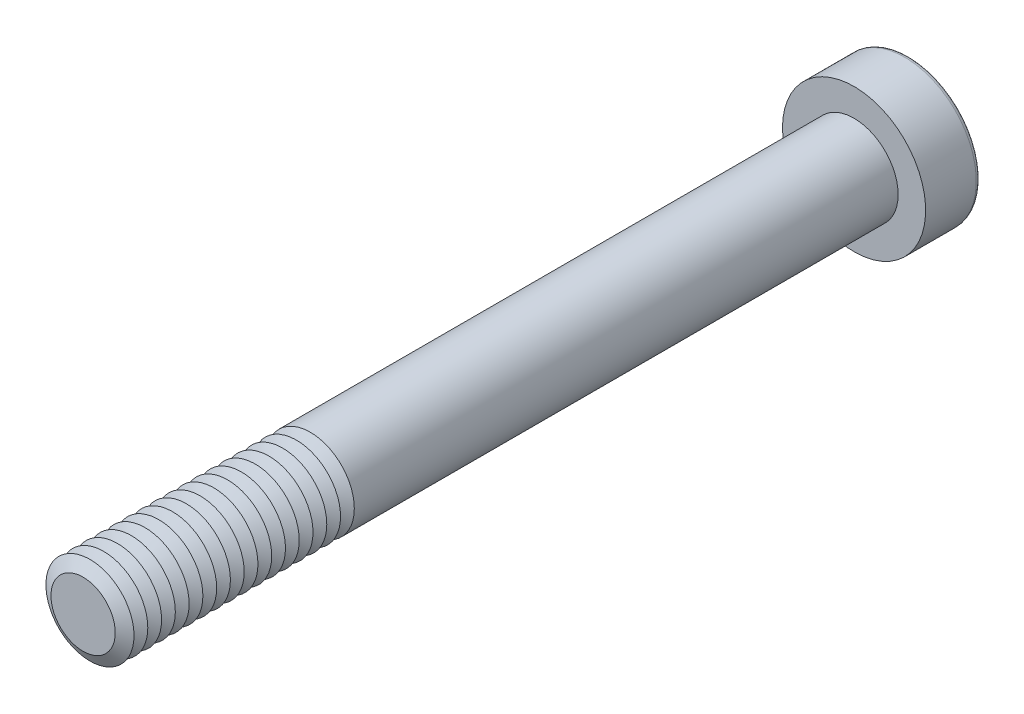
ISO-10303-21;
HEADER;
FILE_DESCRIPTION(('STEP AP214'),'2;1');
FILE_NAME('part.step','',(''),(''),'','','');
FILE_SCHEMA(('AUTOMOTIVE_DESIGN { 1 0 10303 214 1 1 1 1 }'));
ENDSEC;
DATA;
#1=APPLICATION_CONTEXT('core data for automotive mechanical design processes');
#2=APPLICATION_PROTOCOL_DEFINITION('international standard','automotive_design',2000,#1);
#3=PRODUCT_CONTEXT('',#1,'mechanical');
#4=PRODUCT('Part','Part','',(#3));
#5=PRODUCT_RELATED_PRODUCT_CATEGORY('part','',(#4));
#6=PRODUCT_DEFINITION_FORMATION('','',#4);
#7=PRODUCT_DEFINITION_CONTEXT('part definition',#1,'design');
#8=PRODUCT_DEFINITION('design','',#6,#7);
#9=PRODUCT_DEFINITION_SHAPE('','',#8);
#10=(LENGTH_UNIT() NAMED_UNIT(*) SI_UNIT(.MILLI.,.METRE.));
#11=(NAMED_UNIT(*) PLANE_ANGLE_UNIT() SI_UNIT($,.RADIAN.));
#12=(NAMED_UNIT(*) SI_UNIT($,.STERADIAN.) SOLID_ANGLE_UNIT());
#13=UNCERTAINTY_MEASURE_WITH_UNIT(LENGTH_MEASURE(1.E-05),#10,'distance_accuracy_value','');
#14=(GEOMETRIC_REPRESENTATION_CONTEXT(3) GLOBAL_UNCERTAINTY_ASSIGNED_CONTEXT((#13)) GLOBAL_UNIT_ASSIGNED_CONTEXT((#10,
#11,#12)) REPRESENTATION_CONTEXT('',''));
#15=CARTESIAN_POINT('',(0.,0.,0.));
#16=DIRECTION('',(0.,0.,1.));
#17=DIRECTION('',(1.,0.,0.));
#18=AXIS2_PLACEMENT_3D('',#15,#16,#17);
#19=CARTESIAN_POINT('',(0.,0.,65.625));
#20=DIRECTION('',(0.,0.,1.));
#21=DIRECTION('',(1.,0.,0.));
#22=AXIS2_PLACEMENT_3D('',#19,#20,#21);
#23=CONICAL_SURFACE('',#22,4.,1.0471975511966);
#24=CARTESIAN_POINT('',(0.,0.,65.));
#25=DIRECTION('',(0.,0.,1.));
#26=DIRECTION('',(1.,0.,0.));
#27=AXIS2_PLACEMENT_3D('',#24,#25,#26);
#28=CIRCLE('',#27,2.91746824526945);
#29=CARTESIAN_POINT('',(2.91746824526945,0.,65.));
#30=VERTEX_POINT('',#29);
#31=EDGE_CURVE('E313',#30,#30,#28,.T.);
#32=ORIENTED_EDGE('',*,*,#31,.T.);
#33=EDGE_LOOP('',(#32));
#34=FACE_BOUND('',#33,.T.);
#35=CARTESIAN_POINT('',(0.,0.,65.625));
#36=DIRECTION('',(0.,0.,1.));
#37=DIRECTION('',(1.,0.,0.));
#38=AXIS2_PLACEMENT_3D('',#35,#36,#37);
#39=CIRCLE('',#38,4.);
#40=CARTESIAN_POINT('',(4.,0.,65.625));
#41=VERTEX_POINT('',#40);
#42=EDGE_CURVE('E316',#41,#41,#39,.T.);
#43=ORIENTED_EDGE('',*,*,#42,.F.);
#44=EDGE_LOOP('',(#43));
#45=FACE_BOUND('',#44,.T.);
#46=ADVANCED_FACE('F39',(#34,#45),#23,.T.);
#47=CARTESIAN_POINT('',(0.,0.,65.));
#48=DIRECTION('',(0.,0.,-1.));
#49=DIRECTION('',(-1.,0.,0.));
#50=AXIS2_PLACEMENT_3D('',#47,#48,#49);
#51=CONICAL_SURFACE('',#50,2.91746824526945,1.0471975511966);
#52=CARTESIAN_POINT('',(0.,0.,64.375));
#53=DIRECTION('',(0.,0.,1.));
#54=DIRECTION('',(1.,0.,0.));
#55=AXIS2_PLACEMENT_3D('',#52,#53,#54);
#56=CIRCLE('',#55,4.);
#57=CARTESIAN_POINT('',(4.,0.,64.375));
#58=VERTEX_POINT('',#57);
#59=EDGE_CURVE('E324',#58,#58,#56,.T.);
#60=ORIENTED_EDGE('',*,*,#59,.T.);
#61=EDGE_LOOP('',(#60));
#62=FACE_BOUND('',#61,.T.);
#63=ORIENTED_EDGE('',*,*,#31,.F.);
#64=EDGE_LOOP('',(#63));
#65=FACE_BOUND('',#64,.T.);
#66=ADVANCED_FACE('F245',(#62,#65),#51,.T.);
#67=CARTESIAN_POINT('',(0.,0.,70.));
#68=DIRECTION('',(0.,0.,1.));
#69=DIRECTION('',(1.,0.,0.));
#70=AXIS2_PLACEMENT_3D('',#67,#68,#69);
#71=PLANE('',#70);
#72=CARTESIAN_POINT('',(0.,0.,70.));
#73=DIRECTION('',(0.,0.,1.));
#74=DIRECTION('',(1.,0.,0.));
#75=AXIS2_PLACEMENT_3D('',#72,#73,#74);
#76=CIRCLE('',#75,2.91746824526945);
#77=CARTESIAN_POINT('',(2.91746824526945,0.,70.));
#78=VERTEX_POINT('',#77);
#79=EDGE_CURVE('E174',#78,#78,#76,.T.);
#80=ORIENTED_EDGE('',*,*,#79,.T.);
#81=EDGE_LOOP('',(#80));
#82=FACE_BOUND('',#81,.T.);
#83=ADVANCED_FACE('F251',(#82),#71,.T.);
#84=CARTESIAN_POINT('',(0.,0.,70.));
#85=DIRECTION('',(0.,0.,-1.));
#86=DIRECTION('',(-1.,0.,0.));
#87=AXIS2_PLACEMENT_3D('',#84,#85,#86);
#88=CONICAL_SURFACE('',#87,2.91746824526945,1.0471975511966);
#89=CARTESIAN_POINT('',(0.,0.,69.375));
#90=DIRECTION('',(0.,0.,1.));
#91=DIRECTION('',(1.,0.,0.));
#92=AXIS2_PLACEMENT_3D('',#89,#90,#91);
#93=CIRCLE('',#92,4.);
#94=CARTESIAN_POINT('',(4.,0.,69.375));
#95=VERTEX_POINT('',#94);
#96=EDGE_CURVE('E291',#95,#95,#93,.T.);
#97=ORIENTED_EDGE('',*,*,#96,.T.);
#98=EDGE_LOOP('',(#97));
#99=FACE_BOUND('',#98,.T.);
#100=ORIENTED_EDGE('',*,*,#79,.F.);
#101=EDGE_LOOP('',(#100));
#102=FACE_BOUND('',#101,.T.);
#103=ADVANCED_FACE('F199',(#99,#102),#88,.T.);
#104=CARTESIAN_POINT('',(0.,0.,69.375));
#105=DIRECTION('',(0.,0.,1.));
#106=DIRECTION('',(1.,0.,0.));
#107=AXIS2_PLACEMENT_3D('',#104,#105,#106);
#108=CONICAL_SURFACE('',#107,4.,1.0471975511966);
#109=CARTESIAN_POINT('',(0.,0.,68.75));
#110=DIRECTION('',(0.,0.,1.));
#111=DIRECTION('',(1.,0.,0.));
#112=AXIS2_PLACEMENT_3D('',#109,#110,#111);
#113=CIRCLE('',#112,2.91746824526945);
#114=CARTESIAN_POINT('',(2.91746824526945,0.,68.75));
#115=VERTEX_POINT('',#114);
#116=EDGE_CURVE('E288',#115,#115,#113,.T.);
#117=ORIENTED_EDGE('',*,*,#116,.T.);
#118=EDGE_LOOP('',(#117));
#119=FACE_BOUND('',#118,.T.);
#120=ORIENTED_EDGE('',*,*,#96,.F.);
#121=EDGE_LOOP('',(#120));
#122=FACE_BOUND('',#121,.T.);
#123=ADVANCED_FACE('F277',(#119,#122),#108,.T.);
#124=CARTESIAN_POINT('',(0.,0.,68.75));
#125=DIRECTION('',(0.,0.,-1.));
#126=DIRECTION('',(-1.,0.,0.));
#127=AXIS2_PLACEMENT_3D('',#124,#125,#126);
#128=CONICAL_SURFACE('',#127,2.91746824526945,1.0471975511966);
#129=CARTESIAN_POINT('',(0.,0.,68.125));
#130=DIRECTION('',(0.,0.,1.));
#131=DIRECTION('',(1.,0.,0.));
#132=AXIS2_PLACEMENT_3D('',#129,#130,#131);
#133=CIRCLE('',#132,4.);
#134=CARTESIAN_POINT('',(4.,0.,68.125));
#135=VERTEX_POINT('',#134);
#136=EDGE_CURVE('E299',#135,#135,#133,.T.);
#137=ORIENTED_EDGE('',*,*,#136,.T.);
#138=EDGE_LOOP('',(#137));
#139=FACE_BOUND('',#138,.T.);
#140=ORIENTED_EDGE('',*,*,#116,.F.);
#141=EDGE_LOOP('',(#140));
#142=FACE_BOUND('',#141,.T.);
#143=ADVANCED_FACE('F274',(#139,#142),#128,.T.);
#144=CARTESIAN_POINT('',(0.,0.,68.125));
#145=DIRECTION('',(0.,0.,1.));
#146=DIRECTION('',(1.,0.,0.));
#147=AXIS2_PLACEMENT_3D('',#144,#145,#146);
#148=CONICAL_SURFACE('',#147,4.,1.0471975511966);
#149=CARTESIAN_POINT('',(0.,0.,67.5));
#150=DIRECTION('',(0.,0.,1.));
#151=DIRECTION('',(1.,0.,0.));
#152=AXIS2_PLACEMENT_3D('',#149,#150,#151);
#153=CIRCLE('',#152,2.91746824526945);
#154=CARTESIAN_POINT('',(2.91746824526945,0.,67.5));
#155=VERTEX_POINT('',#154);
#156=EDGE_CURVE('E293',#155,#155,#153,.T.);
#157=ORIENTED_EDGE('',*,*,#156,.T.);
#158=EDGE_LOOP('',(#157));
#159=FACE_BOUND('',#158,.T.);
#160=ORIENTED_EDGE('',*,*,#136,.F.);
#161=EDGE_LOOP('',(#160));
#162=FACE_BOUND('',#161,.T.);
#163=ADVANCED_FACE('F270',(#159,#162),#148,.T.);
#164=CARTESIAN_POINT('',(0.,0.,67.5));
#165=DIRECTION('',(0.,0.,-1.));
#166=DIRECTION('',(-1.,0.,0.));
#167=AXIS2_PLACEMENT_3D('',#164,#165,#166);
#168=CONICAL_SURFACE('',#167,2.91746824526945,1.0471975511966);
#169=CARTESIAN_POINT('',(0.,0.,66.875));
#170=DIRECTION('',(0.,0.,1.));
#171=DIRECTION('',(1.,0.,0.));
#172=AXIS2_PLACEMENT_3D('',#169,#170,#171);
#173=CIRCLE('',#172,4.);
#174=CARTESIAN_POINT('',(4.,0.,66.875));
#175=VERTEX_POINT('',#174);
#176=EDGE_CURVE('E309',#175,#175,#173,.T.);
#177=ORIENTED_EDGE('',*,*,#176,.T.);
#178=EDGE_LOOP('',(#177));
#179=FACE_BOUND('',#178,.T.);
#180=ORIENTED_EDGE('',*,*,#156,.F.);
#181=EDGE_LOOP('',(#180));
#182=FACE_BOUND('',#181,.T.);
#183=ADVANCED_FACE('F266',(#179,#182),#168,.T.);
#184=CARTESIAN_POINT('',(0.,0.,66.875));
#185=DIRECTION('',(0.,0.,1.));
#186=DIRECTION('',(1.,0.,0.));
#187=AXIS2_PLACEMENT_3D('',#184,#185,#186);
#188=CONICAL_SURFACE('',#187,4.,1.0471975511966);
#189=CARTESIAN_POINT('',(0.,0.,66.25));
#190=DIRECTION('',(0.,0.,1.));
#191=DIRECTION('',(1.,0.,0.));
#192=AXIS2_PLACEMENT_3D('',#189,#190,#191);
#193=CIRCLE('',#192,2.91746824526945);
#194=CARTESIAN_POINT('',(2.91746824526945,0.,66.25));
#195=VERTEX_POINT('',#194);
#196=EDGE_CURVE('E305',#195,#195,#193,.T.);
#197=ORIENTED_EDGE('',*,*,#196,.T.);
#198=EDGE_LOOP('',(#197));
#199=FACE_BOUND('',#198,.T.);
#200=ORIENTED_EDGE('',*,*,#176,.F.);
#201=EDGE_LOOP('',(#200));
#202=FACE_BOUND('',#201,.T.);
#203=ADVANCED_FACE('F262',(#199,#202),#188,.T.);
#204=CARTESIAN_POINT('',(0.,0.,66.25));
#205=DIRECTION('',(0.,0.,-1.));
#206=DIRECTION('',(-1.,0.,0.));
#207=AXIS2_PLACEMENT_3D('',#204,#205,#206);
#208=CONICAL_SURFACE('',#207,2.91746824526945,1.0471975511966);
#209=ORIENTED_EDGE('',*,*,#42,.T.);
#210=EDGE_LOOP('',(#209));
#211=FACE_BOUND('',#210,.T.);
#212=ORIENTED_EDGE('',*,*,#196,.F.);
#213=EDGE_LOOP('',(#212));
#214=FACE_BOUND('',#213,.T.);
#215=ADVANCED_FACE('F258',(#211,#214),#208,.T.);
#216=CARTESIAN_POINT('',(0.,0.,64.375));
#217=DIRECTION('',(0.,0.,1.));
#218=DIRECTION('',(1.,0.,0.));
#219=AXIS2_PLACEMENT_3D('',#216,#217,#218);
#220=CONICAL_SURFACE('',#219,4.,1.0471975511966);
#221=CARTESIAN_POINT('',(0.,0.,63.75));
#222=DIRECTION('',(0.,0.,1.));
#223=DIRECTION('',(1.,0.,0.));
#224=AXIS2_PLACEMENT_3D('',#221,#222,#223);
#225=CIRCLE('',#224,2.91746824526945);
#226=CARTESIAN_POINT('',(2.91746824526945,0.,63.75));
#227=VERTEX_POINT('',#226);
#228=EDGE_CURVE('E320',#227,#227,#225,.T.);
#229=ORIENTED_EDGE('',*,*,#228,.T.);
#230=EDGE_LOOP('',(#229));
#231=FACE_BOUND('',#230,.T.);
#232=ORIENTED_EDGE('',*,*,#59,.F.);
#233=EDGE_LOOP('',(#232));
#234=FACE_BOUND('',#233,.T.);
#235=ADVANCED_FACE('F261',(#231,#234),#220,.T.);
#236=CARTESIAN_POINT('',(0.,0.,63.75));
#237=DIRECTION('',(0.,0.,-1.));
#238=DIRECTION('',(-1.,0.,0.));
#239=AXIS2_PLACEMENT_3D('',#236,#237,#238);
#240=CONICAL_SURFACE('',#239,2.91746824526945,1.0471975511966);
#241=CARTESIAN_POINT('',(0.,0.,63.125));
#242=DIRECTION('',(0.,0.,1.));
#243=DIRECTION('',(1.,0.,0.));
#244=AXIS2_PLACEMENT_3D('',#241,#242,#243);
#245=CIRCLE('',#244,4.);
#246=CARTESIAN_POINT('',(4.,0.,63.125));
#247=VERTEX_POINT('',#246);
#248=EDGE_CURVE('E332',#247,#247,#245,.T.);
#249=ORIENTED_EDGE('',*,*,#248,.T.);
#250=EDGE_LOOP('',(#249));
#251=FACE_BOUND('',#250,.T.);
#252=ORIENTED_EDGE('',*,*,#228,.F.);
#253=EDGE_LOOP('',(#252));
#254=FACE_BOUND('',#253,.T.);
#255=ADVANCED_FACE('F513',(#251,#254),#240,.T.);
#256=CARTESIAN_POINT('',(0.,0.,63.125));
#257=DIRECTION('',(0.,0.,1.));
#258=DIRECTION('',(1.,0.,0.));
#259=AXIS2_PLACEMENT_3D('',#256,#257,#258);
#260=CONICAL_SURFACE('',#259,4.,1.0471975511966);
#261=CARTESIAN_POINT('',(0.,0.,62.5));
#262=DIRECTION('',(0.,0.,1.));
#263=DIRECTION('',(1.,0.,0.));
#264=AXIS2_PLACEMENT_3D('',#261,#262,#263);
#265=CIRCLE('',#264,2.91746824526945);
#266=CARTESIAN_POINT('',(2.91746824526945,0.,62.5));
#267=VERTEX_POINT('',#266);
#268=EDGE_CURVE('E328',#267,#267,#265,.T.);
#269=ORIENTED_EDGE('',*,*,#268,.T.);
#270=EDGE_LOOP('',(#269));
#271=FACE_BOUND('',#270,.T.);
#272=ORIENTED_EDGE('',*,*,#248,.F.);
#273=EDGE_LOOP('',(#272));
#274=FACE_BOUND('',#273,.T.);
#275=ADVANCED_FACE('F509',(#271,#274),#260,.T.);
#276=CARTESIAN_POINT('',(0.,0.,62.5));
#277=DIRECTION('',(0.,0.,-1.));
#278=DIRECTION('',(-1.,0.,0.));
#279=AXIS2_PLACEMENT_3D('',#276,#277,#278);
#280=CONICAL_SURFACE('',#279,2.91746824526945,1.0471975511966);
#281=CARTESIAN_POINT('',(0.,0.,61.875));
#282=DIRECTION('',(0.,0.,1.));
#283=DIRECTION('',(1.,0.,0.));
#284=AXIS2_PLACEMENT_3D('',#281,#282,#283);
#285=CIRCLE('',#284,4.);
#286=CARTESIAN_POINT('',(4.,0.,61.875));
#287=VERTEX_POINT('',#286);
#288=EDGE_CURVE('E340',#287,#287,#285,.T.);
#289=ORIENTED_EDGE('',*,*,#288,.T.);
#290=EDGE_LOOP('',(#289));
#291=FACE_BOUND('',#290,.T.);
#292=ORIENTED_EDGE('',*,*,#268,.F.);
#293=EDGE_LOOP('',(#292));
#294=FACE_BOUND('',#293,.T.);
#295=ADVANCED_FACE('F505',(#291,#294),#280,.T.);
#296=CARTESIAN_POINT('',(0.,0.,61.875));
#297=DIRECTION('',(0.,0.,1.));
#298=DIRECTION('',(1.,0.,0.));
#299=AXIS2_PLACEMENT_3D('',#296,#297,#298);
#300=CONICAL_SURFACE('',#299,4.,1.0471975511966);
#301=CARTESIAN_POINT('',(0.,0.,61.25));
#302=DIRECTION('',(0.,0.,1.));
#303=DIRECTION('',(1.,0.,0.));
#304=AXIS2_PLACEMENT_3D('',#301,#302,#303);
#305=CIRCLE('',#304,2.91746824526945);
#306=CARTESIAN_POINT('',(2.91746824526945,0.,61.25));
#307=VERTEX_POINT('',#306);
#308=EDGE_CURVE('E336',#307,#307,#305,.T.);
#309=ORIENTED_EDGE('',*,*,#308,.T.);
#310=EDGE_LOOP('',(#309));
#311=FACE_BOUND('',#310,.T.);
#312=ORIENTED_EDGE('',*,*,#288,.F.);
#313=EDGE_LOOP('',(#312));
#314=FACE_BOUND('',#313,.T.);
#315=ADVANCED_FACE('F501',(#311,#314),#300,.T.);
#316=CARTESIAN_POINT('',(0.,0.,61.25));
#317=DIRECTION('',(0.,0.,-1.));
#318=DIRECTION('',(-1.,0.,0.));
#319=AXIS2_PLACEMENT_3D('',#316,#317,#318);
#320=CONICAL_SURFACE('',#319,2.91746824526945,1.0471975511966);
#321=CARTESIAN_POINT('',(0.,0.,60.625));
#322=DIRECTION('',(0.,0.,1.));
#323=DIRECTION('',(1.,0.,0.));
#324=AXIS2_PLACEMENT_3D('',#321,#322,#323);
#325=CIRCLE('',#324,4.);
#326=CARTESIAN_POINT('',(4.,0.,60.625));
#327=VERTEX_POINT('',#326);
#328=EDGE_CURVE('E348',#327,#327,#325,.T.);
#329=ORIENTED_EDGE('',*,*,#328,.T.);
#330=EDGE_LOOP('',(#329));
#331=FACE_BOUND('',#330,.T.);
#332=ORIENTED_EDGE('',*,*,#308,.F.);
#333=EDGE_LOOP('',(#332));
#334=FACE_BOUND('',#333,.T.);
#335=ADVANCED_FACE('F497',(#331,#334),#320,.T.);
#336=CARTESIAN_POINT('',(0.,0.,60.625));
#337=DIRECTION('',(0.,0.,1.));
#338=DIRECTION('',(1.,0.,0.));
#339=AXIS2_PLACEMENT_3D('',#336,#337,#338);
#340=CONICAL_SURFACE('',#339,4.,1.0471975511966);
#341=CARTESIAN_POINT('',(0.,0.,60.));
#342=DIRECTION('',(0.,0.,1.));
#343=DIRECTION('',(1.,0.,0.));
#344=AXIS2_PLACEMENT_3D('',#341,#342,#343);
#345=CIRCLE('',#344,2.91746824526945);
#346=CARTESIAN_POINT('',(2.91746824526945,0.,60.));
#347=VERTEX_POINT('',#346);
#348=EDGE_CURVE('E344',#347,#347,#345,.T.);
#349=ORIENTED_EDGE('',*,*,#348,.T.);
#350=EDGE_LOOP('',(#349));
#351=FACE_BOUND('',#350,.T.);
#352=ORIENTED_EDGE('',*,*,#328,.F.);
#353=EDGE_LOOP('',(#352));
#354=FACE_BOUND('',#353,.T.);
#355=ADVANCED_FACE('F493',(#351,#354),#340,.T.);
#356=CARTESIAN_POINT('',(0.,0.,60.));
#357=DIRECTION('',(0.,0.,-1.));
#358=DIRECTION('',(-1.,0.,0.));
#359=AXIS2_PLACEMENT_3D('',#356,#357,#358);
#360=CONICAL_SURFACE('',#359,2.91746824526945,1.0471975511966);
#361=CARTESIAN_POINT('',(0.,0.,59.375));
#362=DIRECTION('',(0.,0.,1.));
#363=DIRECTION('',(1.,0.,0.));
#364=AXIS2_PLACEMENT_3D('',#361,#362,#363);
#365=CIRCLE('',#364,4.);
#366=CARTESIAN_POINT('',(4.,0.,59.375));
#367=VERTEX_POINT('',#366);
#368=EDGE_CURVE('E356',#367,#367,#365,.T.);
#369=ORIENTED_EDGE('',*,*,#368,.T.);
#370=EDGE_LOOP('',(#369));
#371=FACE_BOUND('',#370,.T.);
#372=ORIENTED_EDGE('',*,*,#348,.F.);
#373=EDGE_LOOP('',(#372));
#374=FACE_BOUND('',#373,.T.);
#375=ADVANCED_FACE('F489',(#371,#374),#360,.T.);
#376=CARTESIAN_POINT('',(0.,0.,59.375));
#377=DIRECTION('',(0.,0.,1.));
#378=DIRECTION('',(1.,0.,0.));
#379=AXIS2_PLACEMENT_3D('',#376,#377,#378);
#380=CONICAL_SURFACE('',#379,4.,1.0471975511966);
#381=CARTESIAN_POINT('',(0.,0.,58.75));
#382=DIRECTION('',(0.,0.,1.));
#383=DIRECTION('',(1.,0.,0.));
#384=AXIS2_PLACEMENT_3D('',#381,#382,#383);
#385=CIRCLE('',#384,2.91746824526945);
#386=CARTESIAN_POINT('',(2.91746824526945,0.,58.75));
#387=VERTEX_POINT('',#386);
#388=EDGE_CURVE('E352',#387,#387,#385,.T.);
#389=ORIENTED_EDGE('',*,*,#388,.T.);
#390=EDGE_LOOP('',(#389));
#391=FACE_BOUND('',#390,.T.);
#392=ORIENTED_EDGE('',*,*,#368,.F.);
#393=EDGE_LOOP('',(#392));
#394=FACE_BOUND('',#393,.T.);
#395=ADVANCED_FACE('F485',(#391,#394),#380,.T.);
#396=CARTESIAN_POINT('',(0.,0.,58.75));
#397=DIRECTION('',(0.,0.,-1.));
#398=DIRECTION('',(-1.,0.,0.));
#399=AXIS2_PLACEMENT_3D('',#396,#397,#398);
#400=CONICAL_SURFACE('',#399,2.91746824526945,1.0471975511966);
#401=CARTESIAN_POINT('',(0.,0.,58.125));
#402=DIRECTION('',(0.,0.,1.));
#403=DIRECTION('',(1.,0.,0.));
#404=AXIS2_PLACEMENT_3D('',#401,#402,#403);
#405=CIRCLE('',#404,4.);
#406=CARTESIAN_POINT('',(4.,0.,58.125));
#407=VERTEX_POINT('',#406);
#408=EDGE_CURVE('E364',#407,#407,#405,.T.);
#409=ORIENTED_EDGE('',*,*,#408,.T.);
#410=EDGE_LOOP('',(#409));
#411=FACE_BOUND('',#410,.T.);
#412=ORIENTED_EDGE('',*,*,#388,.F.);
#413=EDGE_LOOP('',(#412));
#414=FACE_BOUND('',#413,.T.);
#415=ADVANCED_FACE('F481',(#411,#414),#400,.T.);
#416=CARTESIAN_POINT('',(0.,0.,58.125));
#417=DIRECTION('',(0.,0.,1.));
#418=DIRECTION('',(1.,0.,0.));
#419=AXIS2_PLACEMENT_3D('',#416,#417,#418);
#420=CONICAL_SURFACE('',#419,4.,1.0471975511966);
#421=CARTESIAN_POINT('',(0.,0.,57.5));
#422=DIRECTION('',(0.,0.,1.));
#423=DIRECTION('',(1.,0.,0.));
#424=AXIS2_PLACEMENT_3D('',#421,#422,#423);
#425=CIRCLE('',#424,2.91746824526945);
#426=CARTESIAN_POINT('',(2.91746824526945,0.,57.5));
#427=VERTEX_POINT('',#426);
#428=EDGE_CURVE('E360',#427,#427,#425,.T.);
#429=ORIENTED_EDGE('',*,*,#428,.T.);
#430=EDGE_LOOP('',(#429));
#431=FACE_BOUND('',#430,.T.);
#432=ORIENTED_EDGE('',*,*,#408,.F.);
#433=EDGE_LOOP('',(#432));
#434=FACE_BOUND('',#433,.T.);
#435=ADVANCED_FACE('F477',(#431,#434),#420,.T.);
#436=CARTESIAN_POINT('',(0.,0.,57.5));
#437=DIRECTION('',(0.,0.,-1.));
#438=DIRECTION('',(-1.,0.,0.));
#439=AXIS2_PLACEMENT_3D('',#436,#437,#438);
#440=CONICAL_SURFACE('',#439,2.91746824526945,1.0471975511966);
#441=CARTESIAN_POINT('',(0.,0.,56.875));
#442=DIRECTION('',(0.,0.,1.));
#443=DIRECTION('',(1.,0.,0.));
#444=AXIS2_PLACEMENT_3D('',#441,#442,#443);
#445=CIRCLE('',#444,4.);
#446=CARTESIAN_POINT('',(4.,0.,56.875));
#447=VERTEX_POINT('',#446);
#448=EDGE_CURVE('E372',#447,#447,#445,.T.);
#449=ORIENTED_EDGE('',*,*,#448,.T.);
#450=EDGE_LOOP('',(#449));
#451=FACE_BOUND('',#450,.T.);
#452=ORIENTED_EDGE('',*,*,#428,.F.);
#453=EDGE_LOOP('',(#452));
#454=FACE_BOUND('',#453,.T.);
#455=ADVANCED_FACE('F473',(#451,#454),#440,.T.);
#456=CARTESIAN_POINT('',(0.,0.,56.875));
#457=DIRECTION('',(0.,0.,1.));
#458=DIRECTION('',(1.,0.,0.));
#459=AXIS2_PLACEMENT_3D('',#456,#457,#458);
#460=CONICAL_SURFACE('',#459,4.,1.0471975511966);
#461=CARTESIAN_POINT('',(0.,0.,56.25));
#462=DIRECTION('',(0.,0.,1.));
#463=DIRECTION('',(1.,0.,0.));
#464=AXIS2_PLACEMENT_3D('',#461,#462,#463);
#465=CIRCLE('',#464,2.91746824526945);
#466=CARTESIAN_POINT('',(2.91746824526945,0.,56.25));
#467=VERTEX_POINT('',#466);
#468=EDGE_CURVE('E368',#467,#467,#465,.T.);
#469=ORIENTED_EDGE('',*,*,#468,.T.);
#470=EDGE_LOOP('',(#469));
#471=FACE_BOUND('',#470,.T.);
#472=ORIENTED_EDGE('',*,*,#448,.F.);
#473=EDGE_LOOP('',(#472));
#474=FACE_BOUND('',#473,.T.);
#475=ADVANCED_FACE('F469',(#471,#474),#460,.T.);
#476=CARTESIAN_POINT('',(0.,0.,56.25));
#477=DIRECTION('',(0.,0.,-1.));
#478=DIRECTION('',(-1.,0.,0.));
#479=AXIS2_PLACEMENT_3D('',#476,#477,#478);
#480=CONICAL_SURFACE('',#479,2.91746824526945,1.0471975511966);
#481=CARTESIAN_POINT('',(0.,0.,55.625));
#482=DIRECTION('',(0.,0.,1.));
#483=DIRECTION('',(1.,0.,0.));
#484=AXIS2_PLACEMENT_3D('',#481,#482,#483);
#485=CIRCLE('',#484,4.);
#486=CARTESIAN_POINT('',(4.,0.,55.625));
#487=VERTEX_POINT('',#486);
#488=EDGE_CURVE('E380',#487,#487,#485,.T.);
#489=ORIENTED_EDGE('',*,*,#488,.T.);
#490=EDGE_LOOP('',(#489));
#491=FACE_BOUND('',#490,.T.);
#492=ORIENTED_EDGE('',*,*,#468,.F.);
#493=EDGE_LOOP('',(#492));
#494=FACE_BOUND('',#493,.T.);
#495=ADVANCED_FACE('F465',(#491,#494),#480,.T.);
#496=CARTESIAN_POINT('',(0.,0.,55.625));
#497=DIRECTION('',(0.,0.,1.));
#498=DIRECTION('',(1.,0.,0.));
#499=AXIS2_PLACEMENT_3D('',#496,#497,#498);
#500=CONICAL_SURFACE('',#499,4.,1.0471975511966);
#501=CARTESIAN_POINT('',(0.,0.,55.));
#502=DIRECTION('',(0.,0.,1.));
#503=DIRECTION('',(1.,0.,0.));
#504=AXIS2_PLACEMENT_3D('',#501,#502,#503);
#505=CIRCLE('',#504,2.91746824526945);
#506=CARTESIAN_POINT('',(2.91746824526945,0.,55.));
#507=VERTEX_POINT('',#506);
#508=EDGE_CURVE('E376',#507,#507,#505,.T.);
#509=ORIENTED_EDGE('',*,*,#508,.T.);
#510=EDGE_LOOP('',(#509));
#511=FACE_BOUND('',#510,.T.);
#512=ORIENTED_EDGE('',*,*,#488,.F.);
#513=EDGE_LOOP('',(#512));
#514=FACE_BOUND('',#513,.T.);
#515=ADVANCED_FACE('F461',(#511,#514),#500,.T.);
#516=CARTESIAN_POINT('',(0.,0.,55.));
#517=DIRECTION('',(0.,0.,-1.));
#518=DIRECTION('',(-1.,0.,0.));
#519=AXIS2_PLACEMENT_3D('',#516,#517,#518);
#520=CONICAL_SURFACE('',#519,2.91746824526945,1.0471975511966);
#521=CARTESIAN_POINT('',(0.,0.,54.375));
#522=DIRECTION('',(0.,0.,1.));
#523=DIRECTION('',(1.,0.,0.));
#524=AXIS2_PLACEMENT_3D('',#521,#522,#523);
#525=CIRCLE('',#524,4.);
#526=CARTESIAN_POINT('',(4.,0.,54.375));
#527=VERTEX_POINT('',#526);
#528=EDGE_CURVE('E388',#527,#527,#525,.T.);
#529=ORIENTED_EDGE('',*,*,#528,.T.);
#530=EDGE_LOOP('',(#529));
#531=FACE_BOUND('',#530,.T.);
#532=ORIENTED_EDGE('',*,*,#508,.F.);
#533=EDGE_LOOP('',(#532));
#534=FACE_BOUND('',#533,.T.);
#535=ADVANCED_FACE('F457',(#531,#534),#520,.T.);
#536=CARTESIAN_POINT('',(0.,0.,54.375));
#537=DIRECTION('',(0.,0.,1.));
#538=DIRECTION('',(1.,0.,0.));
#539=AXIS2_PLACEMENT_3D('',#536,#537,#538);
#540=CONICAL_SURFACE('',#539,4.,1.0471975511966);
#541=CARTESIAN_POINT('',(0.,0.,53.75));
#542=DIRECTION('',(0.,0.,1.));
#543=DIRECTION('',(1.,0.,0.));
#544=AXIS2_PLACEMENT_3D('',#541,#542,#543);
#545=CIRCLE('',#544,2.91746824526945);
#546=CARTESIAN_POINT('',(2.91746824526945,0.,53.75));
#547=VERTEX_POINT('',#546);
#548=EDGE_CURVE('E384',#547,#547,#545,.T.);
#549=ORIENTED_EDGE('',*,*,#548,.T.);
#550=EDGE_LOOP('',(#549));
#551=FACE_BOUND('',#550,.T.);
#552=ORIENTED_EDGE('',*,*,#528,.F.);
#553=EDGE_LOOP('',(#552));
#554=FACE_BOUND('',#553,.T.);
#555=ADVANCED_FACE('F453',(#551,#554),#540,.T.);
#556=CARTESIAN_POINT('',(0.,0.,53.75));
#557=DIRECTION('',(0.,0.,-1.));
#558=DIRECTION('',(-1.,0.,0.));
#559=AXIS2_PLACEMENT_3D('',#556,#557,#558);
#560=CONICAL_SURFACE('',#559,2.91746824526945,1.0471975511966);
#561=CARTESIAN_POINT('',(0.,0.,53.125));
#562=DIRECTION('',(0.,0.,1.));
#563=DIRECTION('',(1.,0.,0.));
#564=AXIS2_PLACEMENT_3D('',#561,#562,#563);
#565=CIRCLE('',#564,4.);
#566=CARTESIAN_POINT('',(4.,0.,53.125));
#567=VERTEX_POINT('',#566);
#568=EDGE_CURVE('E396',#567,#567,#565,.T.);
#569=ORIENTED_EDGE('',*,*,#568,.T.);
#570=EDGE_LOOP('',(#569));
#571=FACE_BOUND('',#570,.T.);
#572=ORIENTED_EDGE('',*,*,#548,.F.);
#573=EDGE_LOOP('',(#572));
#574=FACE_BOUND('',#573,.T.);
#575=ADVANCED_FACE('F449',(#571,#574),#560,.T.);
#576=CARTESIAN_POINT('',(0.,0.,53.125));
#577=DIRECTION('',(0.,0.,1.));
#578=DIRECTION('',(1.,0.,0.));
#579=AXIS2_PLACEMENT_3D('',#576,#577,#578);
#580=CONICAL_SURFACE('',#579,4.,1.0471975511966);
#581=CARTESIAN_POINT('',(0.,0.,52.5));
#582=DIRECTION('',(0.,0.,1.));
#583=DIRECTION('',(1.,0.,0.));
#584=AXIS2_PLACEMENT_3D('',#581,#582,#583);
#585=CIRCLE('',#584,2.91746824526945);
#586=CARTESIAN_POINT('',(2.91746824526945,0.,52.5));
#587=VERTEX_POINT('',#586);
#588=EDGE_CURVE('E392',#587,#587,#585,.T.);
#589=ORIENTED_EDGE('',*,*,#588,.T.);
#590=EDGE_LOOP('',(#589));
#591=FACE_BOUND('',#590,.T.);
#592=ORIENTED_EDGE('',*,*,#568,.F.);
#593=EDGE_LOOP('',(#592));
#594=FACE_BOUND('',#593,.T.);
#595=ADVANCED_FACE('F445',(#591,#594),#580,.T.);
#596=CARTESIAN_POINT('',(0.,0.,52.5));
#597=DIRECTION('',(0.,0.,-1.));
#598=DIRECTION('',(-1.,0.,0.));
#599=AXIS2_PLACEMENT_3D('',#596,#597,#598);
#600=CONICAL_SURFACE('',#599,2.91746824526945,1.0471975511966);
#601=CARTESIAN_POINT('',(0.,0.,51.875));
#602=DIRECTION('',(0.,0.,1.));
#603=DIRECTION('',(1.,0.,0.));
#604=AXIS2_PLACEMENT_3D('',#601,#602,#603);
#605=CIRCLE('',#604,4.);
#606=CARTESIAN_POINT('',(4.,0.,51.875));
#607=VERTEX_POINT('',#606);
#608=EDGE_CURVE('E404',#607,#607,#605,.T.);
#609=ORIENTED_EDGE('',*,*,#608,.T.);
#610=EDGE_LOOP('',(#609));
#611=FACE_BOUND('',#610,.T.);
#612=ORIENTED_EDGE('',*,*,#588,.F.);
#613=EDGE_LOOP('',(#612));
#614=FACE_BOUND('',#613,.T.);
#615=ADVANCED_FACE('F441',(#611,#614),#600,.T.);
#616=CARTESIAN_POINT('',(0.,0.,51.875));
#617=DIRECTION('',(0.,0.,1.));
#618=DIRECTION('',(1.,0.,0.));
#619=AXIS2_PLACEMENT_3D('',#616,#617,#618);
#620=CONICAL_SURFACE('',#619,4.,1.0471975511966);
#621=CARTESIAN_POINT('',(0.,0.,51.25));
#622=DIRECTION('',(0.,0.,1.));
#623=DIRECTION('',(1.,0.,0.));
#624=AXIS2_PLACEMENT_3D('',#621,#622,#623);
#625=CIRCLE('',#624,2.91746824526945);
#626=CARTESIAN_POINT('',(2.91746824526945,0.,51.25));
#627=VERTEX_POINT('',#626);
#628=EDGE_CURVE('E400',#627,#627,#625,.T.);
#629=ORIENTED_EDGE('',*,*,#628,.T.);
#630=EDGE_LOOP('',(#629));
#631=FACE_BOUND('',#630,.T.);
#632=ORIENTED_EDGE('',*,*,#608,.F.);
#633=EDGE_LOOP('',(#632));
#634=FACE_BOUND('',#633,.T.);
#635=ADVANCED_FACE('F436',(#631,#634),#620,.T.);
#636=CARTESIAN_POINT('',(0.,0.,51.25));
#637=DIRECTION('',(0.,0.,-1.));
#638=DIRECTION('',(-1.,0.,0.));
#639=AXIS2_PLACEMENT_3D('',#636,#637,#638);
#640=CONICAL_SURFACE('',#639,2.91746824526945,1.0471975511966);
#641=CARTESIAN_POINT('',(0.,0.,50.625));
#642=DIRECTION('',(0.,0.,1.));
#643=DIRECTION('',(1.,0.,0.));
#644=AXIS2_PLACEMENT_3D('',#641,#642,#643);
#645=CIRCLE('',#644,4.);
#646=CARTESIAN_POINT('',(4.,0.,50.625));
#647=VERTEX_POINT('',#646);
#648=EDGE_CURVE('E416',#647,#647,#645,.T.);
#649=ORIENTED_EDGE('',*,*,#648,.T.);
#650=EDGE_LOOP('',(#649));
#651=FACE_BOUND('',#650,.T.);
#652=ORIENTED_EDGE('',*,*,#628,.F.);
#653=EDGE_LOOP('',(#652));
#654=FACE_BOUND('',#653,.T.);
#655=ADVANCED_FACE('F422',(#651,#654),#640,.T.);
#656=CARTESIAN_POINT('',(0.,0.,50.625));
#657=DIRECTION('',(0.,0.,1.));
#658=DIRECTION('',(1.,0.,0.));
#659=AXIS2_PLACEMENT_3D('',#656,#657,#658);
#660=CONICAL_SURFACE('',#659,4.,1.0471975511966);
#661=CARTESIAN_POINT('',(0.,0.,50.));
#662=DIRECTION('',(0.,0.,1.));
#663=DIRECTION('',(1.,0.,0.));
#664=AXIS2_PLACEMENT_3D('',#661,#662,#663);
#665=CIRCLE('',#664,2.91746824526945);
#666=CARTESIAN_POINT('',(2.91746824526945,0.,50.));
#667=VERTEX_POINT('',#666);
#668=EDGE_CURVE('E408',#667,#667,#665,.T.);
#669=ORIENTED_EDGE('',*,*,#668,.T.);
#670=EDGE_LOOP('',(#669));
#671=FACE_BOUND('',#670,.T.);
#672=ORIENTED_EDGE('',*,*,#648,.F.);
#673=EDGE_LOOP('',(#672));
#674=FACE_BOUND('',#673,.T.);
#675=ADVANCED_FACE('F425',(#671,#674),#660,.T.);
#676=CARTESIAN_POINT('',(0.,0.,50.));
#677=DIRECTION('',(0.,0.,-1.));
#678=DIRECTION('',(-1.,0.,0.));
#679=AXIS2_PLACEMENT_3D('',#676,#677,#678);
#680=CONICAL_SURFACE('',#679,2.91746824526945,1.0471975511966);
#681=CARTESIAN_POINT('',(0.,0.,49.375));
#682=DIRECTION('',(0.,0.,1.));
#683=DIRECTION('',(1.,0.,0.));
#684=AXIS2_PLACEMENT_3D('',#681,#682,#683);
#685=CIRCLE('',#684,4.);
#686=CARTESIAN_POINT('',(4.,0.,49.375));
#687=VERTEX_POINT('',#686);
#688=EDGE_CURVE('E412',#687,#687,#685,.T.);
#689=ORIENTED_EDGE('',*,*,#688,.T.);
#690=EDGE_LOOP('',(#689));
#691=FACE_BOUND('',#690,.T.);
#692=ORIENTED_EDGE('',*,*,#668,.F.);
#693=EDGE_LOOP('',(#692));
#694=FACE_BOUND('',#693,.T.);
#695=ADVANCED_FACE('F427',(#691,#694),#680,.T.);
#696=CARTESIAN_POINT('',(0.,0.,-1.25));
#697=DIRECTION('',(0.,0.,-1.));
#698=DIRECTION('',(-1.,0.,0.));
#699=AXIS2_PLACEMENT_3D('',#696,#697,#698);
#700=CONICAL_SURFACE('',#699,2.5,1.0471975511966);
#701=CARTESIAN_POINT('',(0.,0.,0.193375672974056));
#702=VERTEX_POINT('',#701);
#703=VERTEX_LOOP('',#702);
#704=FACE_BOUND('',#703,.T.);
#705=CARTESIAN_POINT('',(0.,0.,-1.25));
#706=DIRECTION('',(0.,0.,-1.));
#707=DIRECTION('',(-1.,0.,0.));
#708=AXIS2_PLACEMENT_3D('',#705,#706,#707);
#709=CIRCLE('',#708,2.5);
#710=CARTESIAN_POINT('',(-2.1650635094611,1.25,-1.25));
#711=VERTEX_POINT('',#710);
#712=CARTESIAN_POINT('',(0.,2.5,-1.25));
#713=VERTEX_POINT('',#712);
#714=EDGE_CURVE('E149',#711,#713,#709,.T.);
#715=ORIENTED_EDGE('',*,*,#714,.T.);
#716=CARTESIAN_POINT('',(0.,0.,-1.25));
#717=DIRECTION('',(0.,0.,-1.));
#718=DIRECTION('',(-1.,0.,0.));
#719=AXIS2_PLACEMENT_3D('',#716,#717,#718);
#720=CIRCLE('',#719,2.5);
#721=CARTESIAN_POINT('',(2.1650635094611,1.25,-1.25));
#722=VERTEX_POINT('',#721);
#723=EDGE_CURVE('E54',#713,#722,#720,.T.);
#724=ORIENTED_EDGE('',*,*,#723,.T.);
#725=CARTESIAN_POINT('',(2.1650635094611,-1.25,-1.25));
#726=VERTEX_POINT('',#725);
#727=EDGE_CURVE('E1026',#722,#726,#720,.T.);
#728=ORIENTED_EDGE('',*,*,#727,.T.);
#729=CARTESIAN_POINT('',(0.,-2.5,-1.25));
#730=VERTEX_POINT('',#729);
#731=EDGE_CURVE('E1024',#726,#730,#720,.T.);
#732=ORIENTED_EDGE('',*,*,#731,.T.);
#733=CARTESIAN_POINT('',(-2.1650635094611,-1.25,-1.25));
#734=VERTEX_POINT('',#733);
#735=EDGE_CURVE('E1019',#730,#734,#720,.T.);
#736=ORIENTED_EDGE('',*,*,#735,.T.);
#737=EDGE_CURVE('E1017',#734,#711,#720,.T.);
#738=ORIENTED_EDGE('',*,*,#737,.T.);
#739=EDGE_LOOP('',(#715,#724,#728,#732,#736,#738));
#740=FACE_BOUND('',#739,.T.);
#741=ADVANCED_FACE('F201',(#704,#740),#700,.F.);
#742=CARTESIAN_POINT('',(0.,0.,-1.25));
#743=DIRECTION('',(0.,0.,-1.));
#744=DIRECTION('',(-1.,0.,0.));
#745=AXIS2_PLACEMENT_3D('',#742,#743,#744);
#746=PLANE('',#745);
#747=ORIENTED_EDGE('',*,*,#723,.F.);
#748=DIRECTION('',(1.,0.,0.));
#749=VECTOR('',#748,1.);
#750=CARTESIAN_POINT('',(-1.44337567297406,2.5,-1.25));
#751=LINE('',#750,#749);
#752=CARTESIAN_POINT('',(1.44337567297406,2.5,-1.25));
#753=VERTEX_POINT('',#752);
#754=EDGE_CURVE('E1062',#713,#753,#751,.T.);
#755=ORIENTED_EDGE('',*,*,#754,.T.);
#756=DIRECTION('',(0.5,-0.866025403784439,0.));
#757=VECTOR('',#756,1.);
#758=CARTESIAN_POINT('',(1.44337567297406,2.5,-1.25));
#759=LINE('',#758,#757);
#760=EDGE_CURVE('E155',#753,#722,#759,.T.);
#761=ORIENTED_EDGE('',*,*,#760,.T.);
#762=EDGE_LOOP('',(#747,#755,#761));
#763=FACE_BOUND('',#762,.T.);
#764=ADVANCED_FACE('F608',(#763),#746,.T.);
#765=ORIENTED_EDGE('',*,*,#727,.F.);
#766=CARTESIAN_POINT('',(2.88675134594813,0.,-1.25));
#767=VERTEX_POINT('',#766);
#768=EDGE_CURVE('E1066',#722,#767,#759,.T.);
#769=ORIENTED_EDGE('',*,*,#768,.T.);
#770=DIRECTION('',(-0.5,-0.866025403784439,0.));
#771=VECTOR('',#770,1.);
#772=CARTESIAN_POINT('',(2.88675134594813,0.,-1.25));
#773=LINE('',#772,#771);
#774=EDGE_CURVE('E1038',#767,#726,#773,.T.);
#775=ORIENTED_EDGE('',*,*,#774,.T.);
#776=EDGE_LOOP('',(#765,#769,#775));
#777=FACE_BOUND('',#776,.T.);
#778=ADVANCED_FACE('F618',(#777),#746,.T.);
#779=ORIENTED_EDGE('',*,*,#731,.F.);
#780=CARTESIAN_POINT('',(1.44337567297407,-2.5,-1.25));
#781=VERTEX_POINT('',#780);
#782=EDGE_CURVE('E1040',#726,#781,#773,.T.);
#783=ORIENTED_EDGE('',*,*,#782,.T.);
#784=DIRECTION('',(-1.,0.,0.));
#785=VECTOR('',#784,1.);
#786=CARTESIAN_POINT('',(1.44337567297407,-2.5,-1.25));
#787=LINE('',#786,#785);
#788=EDGE_CURVE('E992',#781,#730,#787,.T.);
#789=ORIENTED_EDGE('',*,*,#788,.T.);
#790=EDGE_LOOP('',(#779,#783,#789));
#791=FACE_BOUND('',#790,.T.);
#792=ADVANCED_FACE('F628',(#791),#746,.T.);
#793=ORIENTED_EDGE('',*,*,#735,.F.);
#794=CARTESIAN_POINT('',(-1.44337567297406,-2.5,-1.25));
#795=VERTEX_POINT('',#794);
#796=EDGE_CURVE('E1034',#730,#795,#787,.T.);
#797=ORIENTED_EDGE('',*,*,#796,.T.);
#798=DIRECTION('',(-0.5,0.866025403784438,0.));
#799=VECTOR('',#798,1.);
#800=CARTESIAN_POINT('',(-1.44337567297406,-2.5,-1.25));
#801=LINE('',#800,#799);
#802=EDGE_CURVE('E1036',#795,#734,#801,.T.);
#803=ORIENTED_EDGE('',*,*,#802,.T.);
#804=EDGE_LOOP('',(#793,#797,#803));
#805=FACE_BOUND('',#804,.T.);
#806=ADVANCED_FACE('F636',(#805),#746,.T.);
#807=ORIENTED_EDGE('',*,*,#737,.F.);
#808=CARTESIAN_POINT('',(-2.88675134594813,0.,-1.25));
#809=VERTEX_POINT('',#808);
#810=EDGE_CURVE('E1042',#734,#809,#801,.T.);
#811=ORIENTED_EDGE('',*,*,#810,.T.);
#812=DIRECTION('',(0.5,0.866025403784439,0.));
#813=VECTOR('',#812,1.);
#814=CARTESIAN_POINT('',(-2.88675134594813,0.,-1.25));
#815=LINE('',#814,#813);
#816=EDGE_CURVE('E158',#809,#711,#815,.T.);
#817=ORIENTED_EDGE('',*,*,#816,.T.);
#818=EDGE_LOOP('',(#807,#811,#817));
#819=FACE_BOUND('',#818,.T.);
#820=ADVANCED_FACE('F231',(#819),#746,.T.);
#821=ORIENTED_EDGE('',*,*,#714,.F.);
#822=CARTESIAN_POINT('',(-1.44337567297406,2.5,-1.25));
#823=VERTEX_POINT('',#822);
#824=EDGE_CURVE('E1047',#711,#823,#815,.T.);
#825=ORIENTED_EDGE('',*,*,#824,.T.);
#826=EDGE_CURVE('E1063',#823,#713,#751,.T.);
#827=ORIENTED_EDGE('',*,*,#826,.T.);
#828=EDGE_LOOP('',(#821,#825,#827));
#829=FACE_BOUND('',#828,.T.);
#830=ADVANCED_FACE('F620',(#829),#746,.T.);
#831=CARTESIAN_POINT('',(-1.44337567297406,2.5,-1.25));
#832=DIRECTION('',(0.,1.,0.));
#833=DIRECTION('',(-1.,0.,0.));
#834=AXIS2_PLACEMENT_3D('',#831,#832,#833);
#835=PLANE('',#834);
#836=DIRECTION('',(0.,0.,-1.));
#837=VECTOR('',#836,1.);
#838=CARTESIAN_POINT('',(-1.44337567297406,2.5,-1.25));
#839=LINE('',#838,#837);
#840=CARTESIAN_POINT('',(-1.44337567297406,2.5,-5.));
#841=VERTEX_POINT('',#840);
#842=EDGE_CURVE('E147',#823,#841,#839,.T.);
#843=ORIENTED_EDGE('',*,*,#842,.T.);
#844=CARTESIAN_POINT('',(-3.76800948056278,2.5,-5.43814611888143));
#845=CARTESIAN_POINT('',(-3.65512241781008,2.5,-5.41294788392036));
#846=CARTESIAN_POINT('',(-3.54216337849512,2.5,-5.38806689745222));
#847=CARTESIAN_POINT('',(-3.31606595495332,2.5,-5.33910944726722));
#848=CARTESIAN_POINT('',(-3.202927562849,2.5,-5.31503301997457));
#849=CARTESIAN_POINT('',(-2.97632910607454,2.5,-5.26783262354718));
#850=CARTESIAN_POINT('',(-2.86286882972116,2.5,-5.24470966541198));
#851=CARTESIAN_POINT('',(-2.63570880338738,2.5,-5.19967851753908));
#852=CARTESIAN_POINT('',(-2.522009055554,2.5,-5.17777031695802));
#853=CARTESIAN_POINT('',(-2.18246936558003,2.5,-5.11464083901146));
#854=CARTESIAN_POINT('',(-1.95621666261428,2.5,-5.07559469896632));
#855=CARTESIAN_POINT('',(-1.50233128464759,2.5,-5.00642421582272));
#856=CARTESIAN_POINT('',(-1.27469889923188,2.5,-4.97629806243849));
#857=CARTESIAN_POINT('',(-0.930935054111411,2.5,-4.9407375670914));
#858=CARTESIAN_POINT('',(-0.815306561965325,2.5,-4.93045885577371));
#859=CARTESIAN_POINT('',(-0.583775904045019,2.5,-4.91374261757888));
#860=CARTESIAN_POINT('',(-0.467873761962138,2.5,-4.9073047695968));
#861=CARTESIAN_POINT('',(-0.235955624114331,2.5,-4.89864425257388));
#862=CARTESIAN_POINT('',(-0.119939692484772,2.5,-4.89641989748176));
#863=CARTESIAN_POINT('',(0.11209426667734,2.5,-4.89632233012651));
#864=CARTESIAN_POINT('',(0.228112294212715,2.5,-4.89844912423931));
#865=CARTESIAN_POINT('',(0.460464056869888,2.5,-4.90693624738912));
#866=CARTESIAN_POINT('',(0.576797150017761,2.5,-4.91331380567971));
#867=CARTESIAN_POINT('',(0.809186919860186,2.5,-4.92994602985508));
#868=CARTESIAN_POINT('',(0.925243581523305,2.5,-4.94020090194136));
#869=CARTESIAN_POINT('',(1.1570783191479,2.5,-4.96408095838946));
#870=CARTESIAN_POINT('',(1.27285617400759,2.5,-4.97770825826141));
#871=CARTESIAN_POINT('',(1.50403978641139,2.5,-5.0077859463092));
#872=CARTESIAN_POINT('',(1.61944554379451,2.5,-5.02423633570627));
#873=CARTESIAN_POINT('',(1.97116037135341,2.5,-5.07794848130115));
#874=CARTESIAN_POINT('',(2.20690405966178,2.5,-5.11889404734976));
#875=CARTESIAN_POINT('',(2.67723558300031,2.5,-5.2069642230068));
#876=CARTESIAN_POINT('',(2.9118232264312,2.5,-5.25408982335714));
#877=CARTESIAN_POINT('',(3.38022088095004,2.5,-5.35235327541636));
#878=CARTESIAN_POINT('',(3.61403064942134,2.5,-5.40349227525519));
#879=CARTESIAN_POINT('',(4.08105387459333,2.5,-5.50842823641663));
#880=CARTESIAN_POINT('',(4.31426731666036,2.5,-5.56222526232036));
#881=CARTESIAN_POINT('',(4.77742011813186,2.5,-5.67097662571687));
#882=CARTESIAN_POINT('',(5.00736469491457,2.5,-5.72590882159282));
#883=CARTESIAN_POINT('',(5.46695141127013,2.5,-5.83704335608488));
#884=CARTESIAN_POINT('',(5.69659354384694,2.5,-5.89324572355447));
#885=CARTESIAN_POINT('',(6.15532898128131,2.5,-6.00649703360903));
#886=CARTESIAN_POINT('',(6.3844226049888,2.5,-6.06354468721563));
#887=CARTESIAN_POINT('',(6.84242442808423,2.5,-6.17834514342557));
#888=CARTESIAN_POINT('',(7.07133263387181,2.5,-6.23609792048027));
#889=CARTESIAN_POINT('',(7.30017784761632,2.5,-6.29409642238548));
#890=B_SPLINE_CURVE_WITH_KNOTS('',3,(#844,#845,#846,#847,#848,#849,#850,#851,#852,#853,#854,
#855,#856,#857,#858,#859,#860,#861,#862,#863,#864,#865,#866,#867,#868,#869,#870,#871,#872,#873,
#874,#875,#876,#877,#878,#879,#880,#881,#882,#883,#884,#885,#886,#887,#888,#889),.UNSPECIFIED.,
.F.,.F.,(4,2,2,2,2,2,2,2,2,2,2,2,2,2,2,2,2,2,2,2,2,2,4),(0.,0.346996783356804,0.694009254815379,
1.04138068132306,1.38874900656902,2.07743762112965,2.76598637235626,3.11418615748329,
3.46235682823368,3.81038814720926,4.15841997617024,4.50787110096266,4.85734081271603,
5.2070303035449,5.55671994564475,6.27438533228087,6.99216591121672,7.71015258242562,
8.42815670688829,9.13739674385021,9.84665290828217,10.5549206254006,11.2631627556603),.UNSPECIFIED.);
#891=CARTESIAN_POINT('',(1.44337567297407,2.5,-5.));
#892=VERTEX_POINT('',#891);
#893=EDGE_CURVE('E124',#841,#892,#890,.T.);
#894=ORIENTED_EDGE('',*,*,#893,.T.);
#895=DIRECTION('',(0.,0.,-1.));
#896=VECTOR('',#895,1.);
#897=CARTESIAN_POINT('',(1.44337567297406,2.5,-1.25));
#898=LINE('',#897,#896);
#899=EDGE_CURVE('E143',#753,#892,#898,.T.);
#900=ORIENTED_EDGE('',*,*,#899,.F.);
#901=ORIENTED_EDGE('',*,*,#754,.F.);
#902=ORIENTED_EDGE('',*,*,#826,.F.);
#903=EDGE_LOOP('',(#843,#894,#900,#901,#902));
#904=FACE_BOUND('',#903,.T.);
#905=ADVANCED_FACE('F141',(#904),#835,.F.);
#906=CARTESIAN_POINT('',(1.44337567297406,2.5,-1.25));
#907=DIRECTION('',(0.866025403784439,0.5,0.));
#908=DIRECTION('',(-0.5,0.866025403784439,0.));
#909=AXIS2_PLACEMENT_3D('',#906,#907,#908);
#910=PLANE('',#909);
#911=ORIENTED_EDGE('',*,*,#899,.T.);
#912=CARTESIAN_POINT('',(1.44326020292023,2.5002,-5.00003094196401));
#913=CARTESIAN_POINT('',(1.50320952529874,2.3963647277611,-4.98395956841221));
#914=CARTESIAN_POINT('',(1.56326755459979,2.29234116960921,-4.96936932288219));
#915=CARTESIAN_POINT('',(1.68359574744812,2.08392662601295,-4.94373552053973));
#916=CARTESIAN_POINT('',(1.7438659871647,1.97953550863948,-4.93269340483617));
#917=CARTESIAN_POINT('',(1.86425311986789,1.77101887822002,-4.91480059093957));
#918=CARTESIAN_POINT('',(1.9243691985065,1.66689477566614,-4.90792855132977));
#919=CARTESIAN_POINT('',(2.04467803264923,1.45851376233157,-4.89871383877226));
#920=CARTESIAN_POINT('',(2.10487077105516,1.35425688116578,-4.89637028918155));
#921=CARTESIAN_POINT('',(2.22525624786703,1.14574311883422,-4.89637028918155));
#922=CARTESIAN_POINT('',(2.28544898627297,1.04148623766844,-4.89871383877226));
#923=CARTESIAN_POINT('',(2.40575782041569,0.833105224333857,-4.90792855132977));
#924=CARTESIAN_POINT('',(2.4658738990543,0.728981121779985,-4.91480059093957));
#925=CARTESIAN_POINT('',(2.58626103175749,0.520464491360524,-4.93269340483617));
#926=CARTESIAN_POINT('',(2.64653127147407,0.416073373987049,-4.94373552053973));
#927=CARTESIAN_POINT('',(2.7668594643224,0.207658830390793,-4.96936932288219));
#928=CARTESIAN_POINT('',(2.82691749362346,0.103635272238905,-4.98395956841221));
#929=CARTESIAN_POINT('',(2.88686681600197,-0.000199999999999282,-5.00003094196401));
#930=B_SPLINE_CURVE_WITH_KNOTS('',3,(#912,#913,#914,#915,#916,#917,#918,#919,#920,#921,#922,
#923,#924,#925,#926,#927,#928,#929),.UNSPECIFIED.,.F.,.F.,(4,2,2,2,2,2,2,2,4),(0.,
0.362931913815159,0.726011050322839,1.08721601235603,1.44835104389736,1.80948607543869,
2.17069103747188,2.53377017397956,2.89670208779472),.UNSPECIFIED.);
#931=CARTESIAN_POINT('',(2.88675134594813,0.,-5.));
#932=VERTEX_POINT('',#931);
#933=EDGE_CURVE('E11',#892,#932,#930,.T.);
#934=ORIENTED_EDGE('',*,*,#933,.T.);
#935=DIRECTION('',(0.,0.,-1.));
#936=VECTOR('',#935,1.);
#937=CARTESIAN_POINT('',(2.88675134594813,0.,-1.25));
#938=LINE('',#937,#936);
#939=EDGE_CURVE('E157',#767,#932,#938,.T.);
#940=ORIENTED_EDGE('',*,*,#939,.F.);
#941=ORIENTED_EDGE('',*,*,#768,.F.);
#942=ORIENTED_EDGE('',*,*,#760,.F.);
#943=EDGE_LOOP('',(#911,#934,#940,#941,#942));
#944=FACE_BOUND('',#943,.T.);
#945=ADVANCED_FACE('F152',(#944),#910,.F.);
#946=CARTESIAN_POINT('',(2.88675134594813,0.,-1.25));
#947=DIRECTION('',(0.866025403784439,-0.5,0.));
#948=DIRECTION('',(0.5,0.866025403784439,0.));
#949=AXIS2_PLACEMENT_3D('',#946,#947,#948);
#950=PLANE('',#949);
#951=ORIENTED_EDGE('',*,*,#939,.T.);
#952=CARTESIAN_POINT('',(2.88686681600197,0.000200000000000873,-5.00003094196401));
#953=CARTESIAN_POINT('',(2.82691749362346,-0.103635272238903,-4.98395956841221));
#954=CARTESIAN_POINT('',(2.7668594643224,-0.207658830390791,-4.96936932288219));
#955=CARTESIAN_POINT('',(2.64653127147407,-0.416073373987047,-4.94373552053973));
#956=CARTESIAN_POINT('',(2.58626103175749,-0.520464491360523,-4.93269340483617));
#957=CARTESIAN_POINT('',(2.4658738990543,-0.728981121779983,-4.91480059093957));
#958=CARTESIAN_POINT('',(2.40575782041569,-0.833105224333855,-4.90792855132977));
#959=CARTESIAN_POINT('',(2.28544898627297,-1.04148623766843,-4.89871383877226));
#960=CARTESIAN_POINT('',(2.22525624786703,-1.14574311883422,-4.89637028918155));
#961=CARTESIAN_POINT('',(2.10487077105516,-1.35425688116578,-4.89637028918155));
#962=CARTESIAN_POINT('',(2.04467803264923,-1.45851376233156,-4.89871383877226));
#963=CARTESIAN_POINT('',(1.9243691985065,-1.66689477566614,-4.90792855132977));
#964=CARTESIAN_POINT('',(1.86425311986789,-1.77101887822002,-4.91480059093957));
#965=CARTESIAN_POINT('',(1.74386598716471,-1.97953550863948,-4.93269340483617));
#966=CARTESIAN_POINT('',(1.68359574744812,-2.08392662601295,-4.94373552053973));
#967=CARTESIAN_POINT('',(1.56326755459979,-2.29234116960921,-4.96936932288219));
#968=CARTESIAN_POINT('',(1.50320952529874,-2.3963647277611,-4.98395956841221));
#969=CARTESIAN_POINT('',(1.44326020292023,-2.5002,-5.00003094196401));
#970=B_SPLINE_CURVE_WITH_KNOTS('',3,(#952,#953,#954,#955,#956,#957,#958,#959,#960,#961,#962,
#963,#964,#965,#966,#967,#968,#969),.UNSPECIFIED.,.F.,.F.,(4,2,2,2,2,2,2,2,4),(0.,
0.362931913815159,0.726011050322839,1.08721601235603,1.44835104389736,1.80948607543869,
2.17069103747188,2.53377017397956,2.89670208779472),.UNSPECIFIED.);
#971=CARTESIAN_POINT('',(1.44337567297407,-2.5,-5.));
#972=VERTEX_POINT('',#971);
#973=EDGE_CURVE('E173',#932,#972,#970,.T.);
#974=ORIENTED_EDGE('',*,*,#973,.T.);
#975=DIRECTION('',(0.,0.,-1.));
#976=VECTOR('',#975,1.);
#977=CARTESIAN_POINT('',(1.44337567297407,-2.5,-1.25));
#978=LINE('',#977,#976);
#979=EDGE_CURVE('E987',#781,#972,#978,.T.);
#980=ORIENTED_EDGE('',*,*,#979,.F.);
#981=ORIENTED_EDGE('',*,*,#782,.F.);
#982=ORIENTED_EDGE('',*,*,#774,.F.);
#983=EDGE_LOOP('',(#951,#974,#980,#981,#982));
#984=FACE_BOUND('',#983,.T.);
#985=ADVANCED_FACE('F191',(#984),#950,.F.);
#986=CARTESIAN_POINT('',(1.44337567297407,-2.5,-1.25));
#987=DIRECTION('',(0.,-1.,0.));
#988=DIRECTION('',(1.,0.,0.));
#989=AXIS2_PLACEMENT_3D('',#986,#987,#988);
#990=PLANE('',#989);
#991=ORIENTED_EDGE('',*,*,#979,.T.);
#992=CARTESIAN_POINT('',(-3.76800948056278,-2.5,-5.43814611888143));
#993=CARTESIAN_POINT('',(-3.65512241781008,-2.5,-5.41294788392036));
#994=CARTESIAN_POINT('',(-3.54216337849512,-2.5,-5.38806689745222));
#995=CARTESIAN_POINT('',(-3.31606595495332,-2.5,-5.33910944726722));
#996=CARTESIAN_POINT('',(-3.202927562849,-2.5,-5.31503301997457));
#997=CARTESIAN_POINT('',(-2.97632910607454,-2.5,-5.26783262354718));
#998=CARTESIAN_POINT('',(-2.86286882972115,-2.5,-5.24470966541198));
#999=CARTESIAN_POINT('',(-2.63570880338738,-2.5,-5.19967851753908));
#1000=CARTESIAN_POINT('',(-2.522009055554,-2.5,-5.17777031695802));
#1001=CARTESIAN_POINT('',(-2.18246936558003,-2.5,-5.11464083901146));
#1002=CARTESIAN_POINT('',(-1.95621666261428,-2.5,-5.07559469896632));
#1003=CARTESIAN_POINT('',(-1.50233128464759,-2.5,-5.00642421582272));
#1004=CARTESIAN_POINT('',(-1.27469889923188,-2.5,-4.97629806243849));
#1005=CARTESIAN_POINT('',(-0.930935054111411,-2.5,-4.9407375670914));
#1006=CARTESIAN_POINT('',(-0.815306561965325,-2.5,-4.93045885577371));
#1007=CARTESIAN_POINT('',(-0.583775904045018,-2.5,-4.91374261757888));
#1008=CARTESIAN_POINT('',(-0.467873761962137,-2.5,-4.9073047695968));
#1009=CARTESIAN_POINT('',(-0.23595562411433,-2.5,-4.89864425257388));
#1010=CARTESIAN_POINT('',(-0.119939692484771,-2.5,-4.89641989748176));
#1011=CARTESIAN_POINT('',(0.112094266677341,-2.5,-4.89632233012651));
#1012=CARTESIAN_POINT('',(0.228112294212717,-2.5,-4.89844912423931));
#1013=CARTESIAN_POINT('',(0.460464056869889,-2.5,-4.90693624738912));
#1014=CARTESIAN_POINT('',(0.576797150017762,-2.5,-4.91331380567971));
#1015=CARTESIAN_POINT('',(0.809186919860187,-2.5,-4.92994602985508));
#1016=CARTESIAN_POINT('',(0.925243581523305,-2.5,-4.94020090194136));
#1017=CARTESIAN_POINT('',(1.1570783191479,-2.5,-4.96408095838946));
#1018=CARTESIAN_POINT('',(1.27285617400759,-2.5,-4.97770825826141));
#1019=CARTESIAN_POINT('',(1.50403978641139,-2.5,-5.0077859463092));
#1020=CARTESIAN_POINT('',(1.61944554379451,-2.5,-5.02423633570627));
#1021=CARTESIAN_POINT('',(1.97116037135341,-2.5,-5.07794848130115));
#1022=CARTESIAN_POINT('',(2.20690405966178,-2.5,-5.11889404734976));
#1023=CARTESIAN_POINT('',(2.67723558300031,-2.5,-5.2069642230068));
#1024=CARTESIAN_POINT('',(2.9118232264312,-2.5,-5.25408982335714));
#1025=CARTESIAN_POINT('',(3.38022088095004,-2.5,-5.35235327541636));
#1026=CARTESIAN_POINT('',(3.61403064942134,-2.5,-5.40349227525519));
#1027=CARTESIAN_POINT('',(4.08105387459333,-2.5,-5.50842823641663));
#1028=CARTESIAN_POINT('',(4.31426731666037,-2.5,-5.56222526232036));
#1029=CARTESIAN_POINT('',(4.77742011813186,-2.5,-5.67097662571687));
#1030=CARTESIAN_POINT('',(5.00736469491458,-2.5,-5.72590882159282));
#1031=CARTESIAN_POINT('',(5.46695141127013,-2.5,-5.83704335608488));
#1032=CARTESIAN_POINT('',(5.69659354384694,-2.5,-5.89324572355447));
#1033=CARTESIAN_POINT('',(6.15532898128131,-2.5,-6.00649703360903));
#1034=CARTESIAN_POINT('',(6.38442260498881,-2.5,-6.06354468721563));
#1035=CARTESIAN_POINT('',(6.84242442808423,-2.5,-6.17834514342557));
#1036=CARTESIAN_POINT('',(7.07133263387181,-2.5,-6.23609792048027));
#1037=CARTESIAN_POINT('',(7.30017784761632,-2.5,-6.29409642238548));
#1038=B_SPLINE_CURVE_WITH_KNOTS('',3,(#992,#993,#994,#995,#996,#997,#998,#999,#1000,#1001,#1002,
#1003,#1004,#1005,#1006,#1007,#1008,#1009,#1010,#1011,#1012,#1013,#1014,#1015,#1016,#1017,#1018,
#1019,#1020,#1021,#1022,#1023,#1024,#1025,#1026,#1027,#1028,#1029,#1030,#1031,#1032,#1033,#1034,
#1035,#1036,#1037),.UNSPECIFIED.,.F.,.F.,(4,2,2,2,2,2,2,2,2,2,2,2,2,2,2,2,2,2,2,2,2,2,4),(0.,
0.346996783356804,0.69400925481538,1.04138068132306,1.38874900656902,2.07743762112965,
2.76598637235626,3.11418615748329,3.46235682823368,3.81038814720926,4.15841997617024,
4.50787110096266,4.85734081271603,5.20703030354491,5.55671994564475,6.27438533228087,
6.99216591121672,7.71015258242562,8.42815670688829,9.13739674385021,9.84665290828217,
10.5549206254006,11.2631627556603),.UNSPECIFIED.);
#1039=CARTESIAN_POINT('',(-1.44337567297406,-2.5,-5.));
#1040=VERTEX_POINT('',#1039);
#1041=EDGE_CURVE('E184',#972,#1040,#1038,.F.);
#1042=ORIENTED_EDGE('',*,*,#1041,.T.);
#1043=DIRECTION('',(0.,0.,-1.));
#1044=VECTOR('',#1043,1.);
#1045=CARTESIAN_POINT('',(-1.44337567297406,-2.5,-1.25));
#1046=LINE('',#1045,#1044);
#1047=EDGE_CURVE('E993',#795,#1040,#1046,.T.);
#1048=ORIENTED_EDGE('',*,*,#1047,.F.);
#1049=ORIENTED_EDGE('',*,*,#796,.F.);
#1050=ORIENTED_EDGE('',*,*,#788,.F.);
#1051=EDGE_LOOP('',(#991,#1042,#1048,#1049,#1050));
#1052=FACE_BOUND('',#1051,.T.);
#1053=ADVANCED_FACE('F234',(#1052),#990,.F.);
#1054=CARTESIAN_POINT('',(-1.44337567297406,-2.5,-1.25));
#1055=DIRECTION('',(-0.866025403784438,-0.5,0.));
#1056=DIRECTION('',(0.5,-0.866025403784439,0.));
#1057=AXIS2_PLACEMENT_3D('',#1054,#1055,#1056);
#1058=PLANE('',#1057);
#1059=ORIENTED_EDGE('',*,*,#1047,.T.);
#1060=CARTESIAN_POINT('',(-1.44326020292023,-2.5002,-5.00003094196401));
#1061=CARTESIAN_POINT('',(-1.50320952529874,-2.3963647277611,-4.98395956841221));
#1062=CARTESIAN_POINT('',(-1.56326755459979,-2.29234116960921,-4.96936932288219));
#1063=CARTESIAN_POINT('',(-1.68359574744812,-2.08392662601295,-4.94373552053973));
#1064=CARTESIAN_POINT('',(-1.7438659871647,-1.97953550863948,-4.93269340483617));
#1065=CARTESIAN_POINT('',(-1.86425311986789,-1.77101887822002,-4.91480059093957));
#1066=CARTESIAN_POINT('',(-1.9243691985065,-1.66689477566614,-4.90792855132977));
#1067=CARTESIAN_POINT('',(-2.04467803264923,-1.45851376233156,-4.89871383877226));
#1068=CARTESIAN_POINT('',(-2.10487077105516,-1.35425688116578,-4.89637028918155));
#1069=CARTESIAN_POINT('',(-2.22525624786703,-1.14574311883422,-4.89637028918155));
#1070=CARTESIAN_POINT('',(-2.28544898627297,-1.04148623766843,-4.89871383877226));
#1071=CARTESIAN_POINT('',(-2.40575782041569,-0.833105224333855,-4.90792855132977));
#1072=CARTESIAN_POINT('',(-2.4658738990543,-0.728981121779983,-4.91480059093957));
#1073=CARTESIAN_POINT('',(-2.58626103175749,-0.520464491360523,-4.93269340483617));
#1074=CARTESIAN_POINT('',(-2.64653127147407,-0.416073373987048,-4.94373552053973));
#1075=CARTESIAN_POINT('',(-2.7668594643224,-0.207658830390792,-4.96936932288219));
#1076=CARTESIAN_POINT('',(-2.82691749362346,-0.103635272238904,-4.98395956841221));
#1077=CARTESIAN_POINT('',(-2.88686681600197,0.000199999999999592,-5.00003094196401));
#1078=B_SPLINE_CURVE_WITH_KNOTS('',3,(#1060,#1061,#1062,#1063,#1064,#1065,#1066,#1067,#1068,
#1069,#1070,#1071,#1072,#1073,#1074,#1075,#1076,#1077),.UNSPECIFIED.,.F.,.F.,(4,2,2,2,2,2,2,2,
4),(0.,0.362931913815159,0.726011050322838,1.08721601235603,1.44835104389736,1.80948607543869,
2.17069103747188,2.53377017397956,2.89670208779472),.UNSPECIFIED.);
#1079=CARTESIAN_POINT('',(-2.88675134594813,0.,-5.));
#1080=VERTEX_POINT('',#1079);
#1081=EDGE_CURVE('E208',#1040,#1080,#1078,.T.);
#1082=ORIENTED_EDGE('',*,*,#1081,.T.);
#1083=DIRECTION('',(0.,0.,-1.));
#1084=VECTOR('',#1083,1.);
#1085=CARTESIAN_POINT('',(-2.88675134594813,0.,-1.25));
#1086=LINE('',#1085,#1084);
#1087=EDGE_CURVE('E997',#809,#1080,#1086,.T.);
#1088=ORIENTED_EDGE('',*,*,#1087,.F.);
#1089=ORIENTED_EDGE('',*,*,#810,.F.);
#1090=ORIENTED_EDGE('',*,*,#802,.F.);
#1091=EDGE_LOOP('',(#1059,#1082,#1088,#1089,#1090));
#1092=FACE_BOUND('',#1091,.T.);
#1093=ADVANCED_FACE('F229',(#1092),#1058,.F.);
#1094=CARTESIAN_POINT('',(-2.88675134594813,0.,-1.25));
#1095=DIRECTION('',(-0.866025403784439,0.5,0.));
#1096=DIRECTION('',(-0.5,-0.866025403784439,0.));
#1097=AXIS2_PLACEMENT_3D('',#1094,#1095,#1096);
#1098=PLANE('',#1097);
#1099=ORIENTED_EDGE('',*,*,#1087,.T.);
#1100=CARTESIAN_POINT('',(-2.88686681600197,-0.000200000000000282,-5.00003094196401));
#1101=CARTESIAN_POINT('',(-2.82691749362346,0.103635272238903,-4.98395956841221));
#1102=CARTESIAN_POINT('',(-2.7668594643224,0.207658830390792,-4.96936932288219));
#1103=CARTESIAN_POINT('',(-2.64653127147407,0.416073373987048,-4.94373552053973));
#1104=CARTESIAN_POINT('',(-2.58626103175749,0.520464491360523,-4.93269340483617));
#1105=CARTESIAN_POINT('',(-2.4658738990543,0.728981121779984,-4.91480059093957));
#1106=CARTESIAN_POINT('',(-2.40575782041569,0.833105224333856,-4.90792855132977));
#1107=CARTESIAN_POINT('',(-2.28544898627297,1.04148623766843,-4.89871383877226));
#1108=CARTESIAN_POINT('',(-2.22525624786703,1.14574311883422,-4.89637028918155));
#1109=CARTESIAN_POINT('',(-2.10487077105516,1.35425688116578,-4.89637028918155));
#1110=CARTESIAN_POINT('',(-2.04467803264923,1.45851376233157,-4.89871383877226));
#1111=CARTESIAN_POINT('',(-1.9243691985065,1.66689477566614,-4.90792855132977));
#1112=CARTESIAN_POINT('',(-1.86425311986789,1.77101887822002,-4.91480059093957));
#1113=CARTESIAN_POINT('',(-1.7438659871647,1.97953550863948,-4.93269340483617));
#1114=CARTESIAN_POINT('',(-1.68359574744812,2.08392662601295,-4.94373552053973));
#1115=CARTESIAN_POINT('',(-1.56326755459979,2.29234116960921,-4.96936932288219));
#1116=CARTESIAN_POINT('',(-1.50320952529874,2.3963647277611,-4.98395956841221));
#1117=CARTESIAN_POINT('',(-1.44326020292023,2.5002,-5.00003094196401));
#1118=B_SPLINE_CURVE_WITH_KNOTS('',3,(#1100,#1101,#1102,#1103,#1104,#1105,#1106,#1107,#1108,
#1109,#1110,#1111,#1112,#1113,#1114,#1115,#1116,#1117),.UNSPECIFIED.,.F.,.F.,(4,2,2,2,2,2,2,2,
4),(0.,0.362931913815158,0.726011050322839,1.08721601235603,1.44835104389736,1.80948607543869,
2.17069103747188,2.53377017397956,2.89670208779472),.UNSPECIFIED.);
#1119=EDGE_CURVE('E150',#1080,#841,#1118,.T.);
#1120=ORIENTED_EDGE('',*,*,#1119,.T.);
#1121=ORIENTED_EDGE('',*,*,#842,.F.);
#1122=ORIENTED_EDGE('',*,*,#824,.F.);
#1123=ORIENTED_EDGE('',*,*,#816,.F.);
#1124=EDGE_LOOP('',(#1099,#1120,#1121,#1122,#1123));
#1125=FACE_BOUND('',#1124,.T.);
#1126=ADVANCED_FACE('F197',(#1125),#1098,.F.);
#1127=CARTESIAN_POINT('',(0.,0.,-5.));
#1128=DIRECTION('',(0.,0.,-1.));
#1129=DIRECTION('',(-1.,0.,0.));
#1130=AXIS2_PLACEMENT_3D('',#1127,#1128,#1129);
#1131=CONICAL_SURFACE('',#1130,2.88675134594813,1.30899693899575);
#1132=CARTESIAN_POINT('',(0.,0.,-5.));
#1133=DIRECTION('',(0.,0.,-1.));
#1134=DIRECTION('',(-1.,0.,0.));
#1135=AXIS2_PLACEMENT_3D('',#1132,#1133,#1134);
#1136=CIRCLE('',#1135,2.88675134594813);
#1137=EDGE_CURVE('E120',#841,#892,#1136,.T.);
#1138=ORIENTED_EDGE('',*,*,#1137,.T.);
#1139=ORIENTED_EDGE('',*,*,#893,.F.);
#1140=EDGE_LOOP('',(#1138,#1139));
#1141=FACE_BOUND('',#1140,.T.);
#1142=ADVANCED_FACE('F122',(#1141),#1131,.F.);
#1143=EDGE_CURVE('E129',#892,#932,#1136,.T.);
#1144=ORIENTED_EDGE('',*,*,#1143,.T.);
#1145=ORIENTED_EDGE('',*,*,#933,.F.);
#1146=EDGE_LOOP('',(#1144,#1145));
#1147=FACE_BOUND('',#1146,.T.);
#1148=ADVANCED_FACE('F133',(#1147),#1131,.F.);
#1149=EDGE_CURVE('E164',#932,#972,#1136,.T.);
#1150=ORIENTED_EDGE('',*,*,#1149,.T.);
#1151=ORIENTED_EDGE('',*,*,#973,.F.);
#1152=EDGE_LOOP('',(#1150,#1151));
#1153=FACE_BOUND('',#1152,.T.);
#1154=ADVANCED_FACE('F701',(#1153),#1131,.F.);
#1155=EDGE_CURVE('E169',#972,#1040,#1136,.T.);
#1156=ORIENTED_EDGE('',*,*,#1155,.T.);
#1157=ORIENTED_EDGE('',*,*,#1041,.F.);
#1158=EDGE_LOOP('',(#1156,#1157));
#1159=FACE_BOUND('',#1158,.T.);
#1160=ADVANCED_FACE('F708',(#1159),#1131,.F.);
#1161=EDGE_CURVE('E67',#1040,#1080,#1136,.T.);
#1162=ORIENTED_EDGE('',*,*,#1161,.T.);
#1163=ORIENTED_EDGE('',*,*,#1081,.F.);
#1164=EDGE_LOOP('',(#1162,#1163));
#1165=FACE_BOUND('',#1164,.T.);
#1166=ADVANCED_FACE('F716',(#1165),#1131,.F.);
#1167=EDGE_CURVE('E60',#1080,#841,#1136,.T.);
#1168=ORIENTED_EDGE('',*,*,#1167,.T.);
#1169=ORIENTED_EDGE('',*,*,#1119,.F.);
#1170=EDGE_LOOP('',(#1168,#1169));
#1171=FACE_BOUND('',#1170,.T.);
#1172=ADVANCED_FACE('F198',(#1171),#1131,.F.);
#1173=CARTESIAN_POINT('',(0.,0.,-5.));
#1174=DIRECTION('',(0.,0.,-1.));
#1175=DIRECTION('',(-1.,0.,0.));
#1176=AXIS2_PLACEMENT_3D('',#1173,#1174,#1175);
#1177=PLANE('',#1176);
#1178=ORIENTED_EDGE('',*,*,#1167,.F.);
#1179=ORIENTED_EDGE('',*,*,#1161,.F.);
#1180=ORIENTED_EDGE('',*,*,#1155,.F.);
#1181=ORIENTED_EDGE('',*,*,#1149,.F.);
#1182=ORIENTED_EDGE('',*,*,#1143,.F.);
#1183=ORIENTED_EDGE('',*,*,#1137,.F.);
#1184=EDGE_LOOP('',(#1178,#1179,#1180,#1181,#1182,#1183));
#1185=FACE_BOUND('',#1184,.T.);
#1186=CARTESIAN_POINT('',(0.,0.,-5.));
#1187=DIRECTION('',(0.,0.,-1.));
#1188=DIRECTION('',(-1.,0.,0.));
#1189=AXIS2_PLACEMENT_3D('',#1186,#1187,#1188);
#1190=CIRCLE('',#1189,6.1);
#1191=CARTESIAN_POINT('',(-6.1,0.,-5.));
#1192=VERTEX_POINT('',#1191);
#1193=EDGE_CURVE('E1011',#1192,#1192,#1190,.T.);
#1194=ORIENTED_EDGE('',*,*,#1193,.T.);
#1195=EDGE_LOOP('',(#1194));
#1196=FACE_BOUND('',#1195,.T.);
#1197=ADVANCED_FACE('F161',(#1185,#1196),#1177,.T.);
#1198=CARTESIAN_POINT('',(0.,0.,-4.6));
#1199=DIRECTION('',(0.,0.,-1.));
#1200=DIRECTION('',(-1.,0.,0.));
#1201=AXIS2_PLACEMENT_3D('',#1198,#1199,#1200);
#1202=TOROIDAL_SURFACE('',#1201,6.1,0.4);
#1203=CARTESIAN_POINT('',(0.,0.,-4.6));
#1204=DIRECTION('',(0.,0.,-1.));
#1205=DIRECTION('',(-1.,0.,0.));
#1206=AXIS2_PLACEMENT_3D('',#1203,#1204,#1205);
#1207=CIRCLE('',#1206,6.5);
#1208=CARTESIAN_POINT('',(-6.5,0.,-4.6));
#1209=VERTEX_POINT('',#1208);
#1210=EDGE_CURVE('E1014',#1209,#1209,#1207,.F.);
#1211=ORIENTED_EDGE('',*,*,#1210,.F.);
#1212=EDGE_LOOP('',(#1211));
#1213=FACE_BOUND('',#1212,.T.);
#1214=ORIENTED_EDGE('',*,*,#1193,.F.);
#1215=EDGE_LOOP('',(#1214));
#1216=FACE_BOUND('',#1215,.T.);
#1217=ADVANCED_FACE('F41',(#1213,#1216),#1202,.T.);
#1218=CARTESIAN_POINT('',(0.,0.,-5.));
#1219=DIRECTION('',(0.,0.,1.));
#1220=DIRECTION('',(1.,0.,0.));
#1221=AXIS2_PLACEMENT_3D('',#1218,#1219,#1220);
#1222=CYLINDRICAL_SURFACE('',#1221,6.5);
#1223=ORIENTED_EDGE('',*,*,#1210,.T.);
#1224=EDGE_LOOP('',(#1223));
#1225=FACE_BOUND('',#1224,.T.);
#1226=CARTESIAN_POINT('',(0.,0.,0.));
#1227=DIRECTION('',(0.,0.,-1.));
#1228=DIRECTION('',(-1.,0.,0.));
#1229=AXIS2_PLACEMENT_3D('',#1226,#1227,#1228);
#1230=CIRCLE('',#1229,6.5);
#1231=CARTESIAN_POINT('',(-6.5,0.,0.));
#1232=VERTEX_POINT('',#1231);
#1233=EDGE_CURVE('E1003',#1232,#1232,#1230,.T.);
#1234=ORIENTED_EDGE('',*,*,#1233,.T.);
#1235=EDGE_LOOP('',(#1234));
#1236=FACE_BOUND('',#1235,.T.);
#1237=ADVANCED_FACE('F740',(#1225,#1236),#1222,.T.);
#1238=CARTESIAN_POINT('',(0.,0.,0.));
#1239=DIRECTION('',(0.,0.,-1.));
#1240=DIRECTION('',(-1.,0.,0.));
#1241=AXIS2_PLACEMENT_3D('',#1238,#1239,#1240);
#1242=PLANE('',#1241);
#1243=CARTESIAN_POINT('',(0.,0.,0.));
#1244=DIRECTION('',(0.,0.,1.));
#1245=DIRECTION('',(1.,0.,0.));
#1246=AXIS2_PLACEMENT_3D('',#1243,#1244,#1245);
#1247=CIRCLE('',#1246,4.);
#1248=CARTESIAN_POINT('',(4.,0.,0.));
#1249=VERTEX_POINT('',#1248);
#1250=EDGE_CURVE('E1007',#1249,#1249,#1247,.T.);
#1251=ORIENTED_EDGE('',*,*,#1250,.F.);
#1252=EDGE_LOOP('',(#1251));
#1253=FACE_BOUND('',#1252,.T.);
#1254=ORIENTED_EDGE('',*,*,#1233,.F.);
#1255=EDGE_LOOP('',(#1254));
#1256=FACE_BOUND('',#1255,.T.);
#1257=ADVANCED_FACE('F748',(#1253,#1256),#1242,.F.);
#1258=CARTESIAN_POINT('',(0.,0.,70.));
#1259=DIRECTION('',(0.,0.,-1.));
#1260=DIRECTION('',(-1.,0.,0.));
#1261=AXIS2_PLACEMENT_3D('',#1258,#1259,#1260);
#1262=CYLINDRICAL_SURFACE('',#1261,4.);
#1263=ORIENTED_EDGE('',*,*,#1250,.T.);
#1264=EDGE_LOOP('',(#1263));
#1265=FACE_BOUND('',#1264,.T.);
#1266=ORIENTED_EDGE('',*,*,#688,.F.);
#1267=EDGE_LOOP('',(#1266));
#1268=FACE_BOUND('',#1267,.T.);
#1269=ADVANCED_FACE('F757',(#1265,#1268),#1262,.T.);
#1270=CLOSED_SHELL('',(#46,#66,#83,#103,#123,#143,#163,#183,#203,#215,#235,#255,#275,#295,#315,
#335,#355,#375,#395,#415,#435,#455,#475,#495,#515,#535,#555,#575,#595,#615,#635,#655,#675,#695,
#741,#764,#778,#792,#806,#820,#830,#905,#945,#985,#1053,#1093,#1126,#1142,#1148,#1154,#1160,
#1166,#1172,#1197,#1217,#1237,#1257,#1269));
#1271=MANIFOLD_SOLID_BREP('B2',#1270);
#1272=ADVANCED_BREP_SHAPE_REPRESENTATION('',(#18,#1271),#14);
#1273=SHAPE_DEFINITION_REPRESENTATION(#9,#1272);
ENDSEC;
END-ISO-10303-21;
